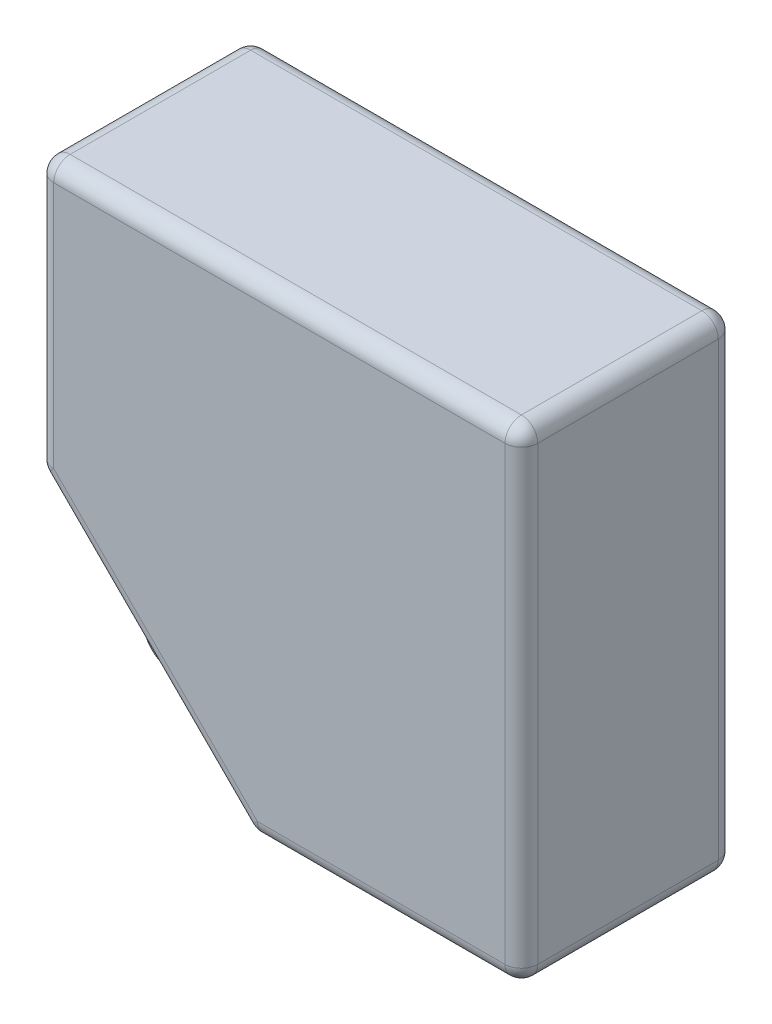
from build123d import *

# Parameters (mm, degrees)
SKIZZE1_W               = 59
SKIZZE1_H               = 59
LINEAR_AUSTRAGEN1_DEPTH = 26
FASE1_SIZE              = 26
VERRUNDUNG1_R           = 2
SKIZZE2_R               = 5.1
LINEAR_AUSTRAGEN2_DEPTH = 10


with BuildPart() as part:
    # Skizze1 → Linear austragen1 (new body)
    with BuildSketch(Plane.XY):
        with Locations((-21.87374419, -3.079217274)):
            Rectangle(SKIZZE1_W, SKIZZE1_H)
    extrude(amount=LINEAR_AUSTRAGEN1_DEPTH)

    # Fase1
    fase1_edges = [part.edges().sort_by_distance(p)[0] for p in [
        (-51.37374419, -32.579217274, 13),
    ]]
    chamfer(fase1_edges, length=FASE1_SIZE)

    # Verrundung1
    verrundung1_edges = [part.edges().sort_by_distance(p)[0] for p in [
        (7.62625581, -3.079217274, 26),
        (-8.87374419, -32.579217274, 0),
        (-21.87374419, 26.420782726, 26),
        (-8.87374419, -32.579217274, 26),
        (-25.37374419, -32.579217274, 13),
        (-38.37374419, -19.579217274, 0),
        (-51.37374419, -6.579217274, 13),
        (-38.37374419, -19.579217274, 26),
        (-51.37374419, 9.920782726, 26),
        (-21.87374419, 26.420782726, 0),
        (7.62625581, -3.079217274, 0),
        (-51.37374419, 9.920782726, 0),
        (-51.37374419, 26.420782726, 13),
        (7.62625581, 26.420782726, 13),
        (7.62625581, -32.579217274, 13),
    ]]
    fillet(verrundung1_edges, radius=VERRUNDUNG1_R)

    # Skizze2 → Linear austragen2 (add)
    with BuildSketch(Plane(origin=(-28.976480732, -28.976480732, 0), x_dir=(0, 0, 1), z_dir=(-0.7071067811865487, -0.7071067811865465, 0))):
        with Locations(Location((13.001442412, 13.096086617, 0), (0, 0, 270))):
            Circle(SKIZZE2_R)
    extrude(amount=LINEAR_AUSTRAGEN2_DEPTH)


solid = part.part
